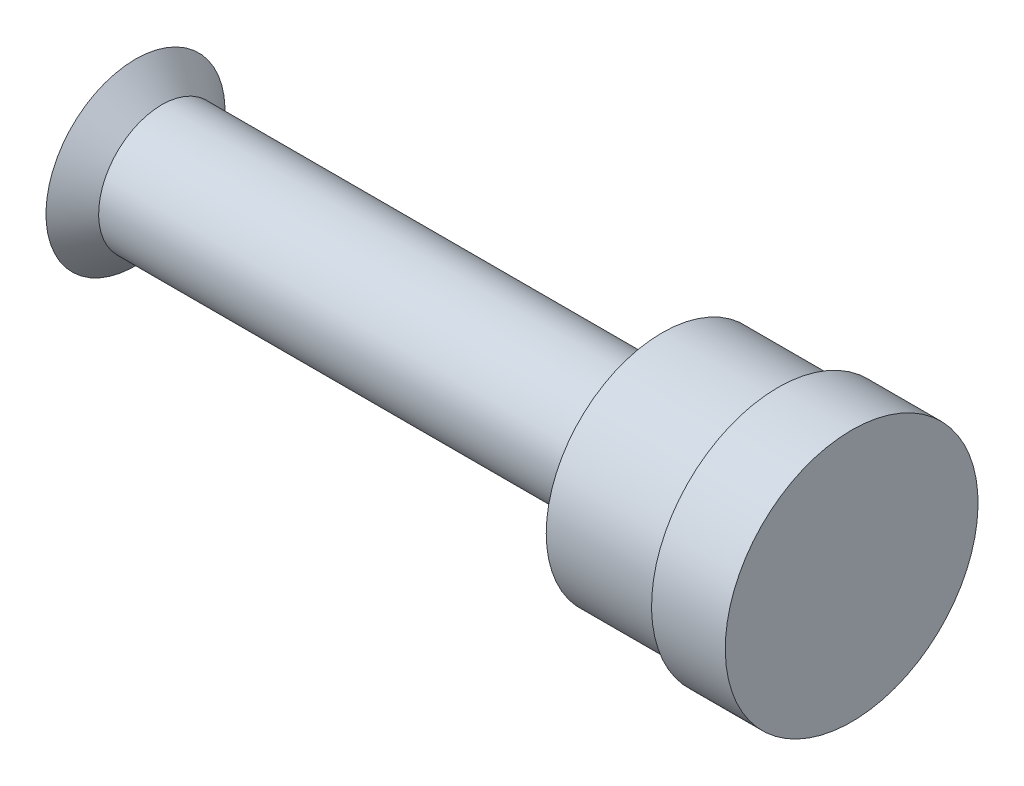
from build123d import *


with BuildPart() as part:
    # Skica1 → Rotovat1 (revolve)
    with BuildSketch(Plane.XY):
        Polygon((0, 0), (0, 4.25), (1.25, 3), (25, 3), (25, 5.5), (30.5, 5.5), (30.5, 6), (34, 6), (34, 0), align=None)
    revolve(axis=Axis((34, 0, 0), (-1, 0, 0)))


solid = part.part
